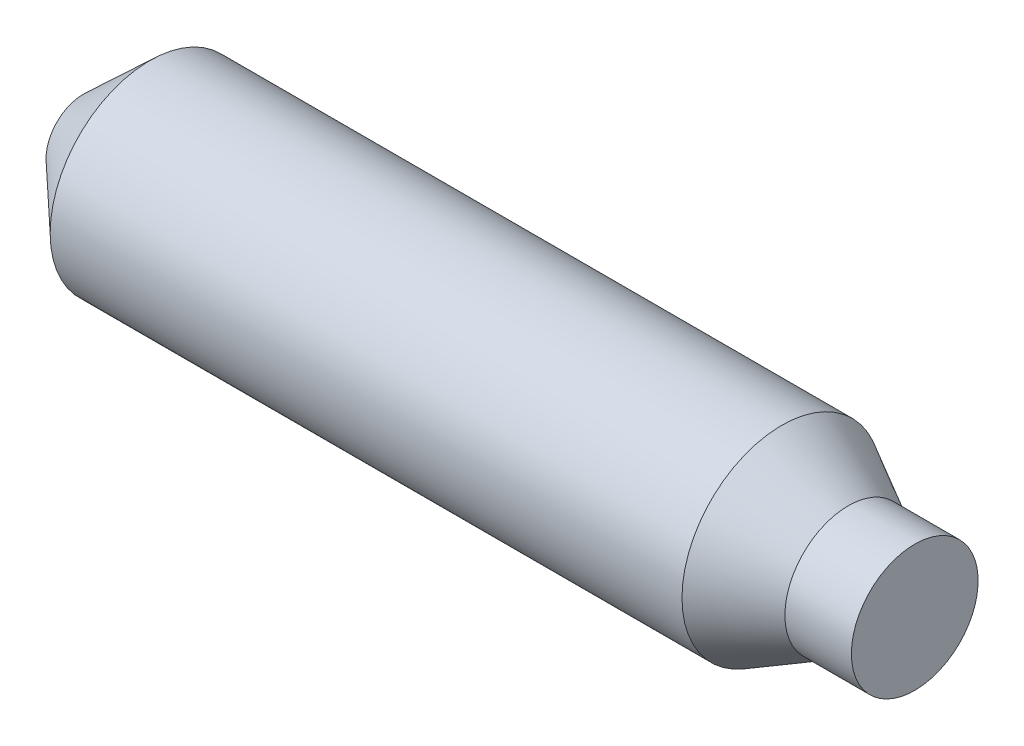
from build123d import *


with BuildPart() as part:
    # Esquisse1 → Base-R_volution (revolve)
    with BuildSketch(Plane.XY, mode=Mode.PRIVATE) as base_r_volution_sk:
        Polygon((0, 0), (0, 22.5), (40, 60), (420, 60), (460, 38.110119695), (500, 38.110119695), (500, 0), align=None)
    revolve(base_r_volution_sk.sketch.rotate(Axis((0, 0, 0), (1, 0, 0)), 90), axis=Axis((0, 0, 0), (1, 0, 0)))


solid = part.part
